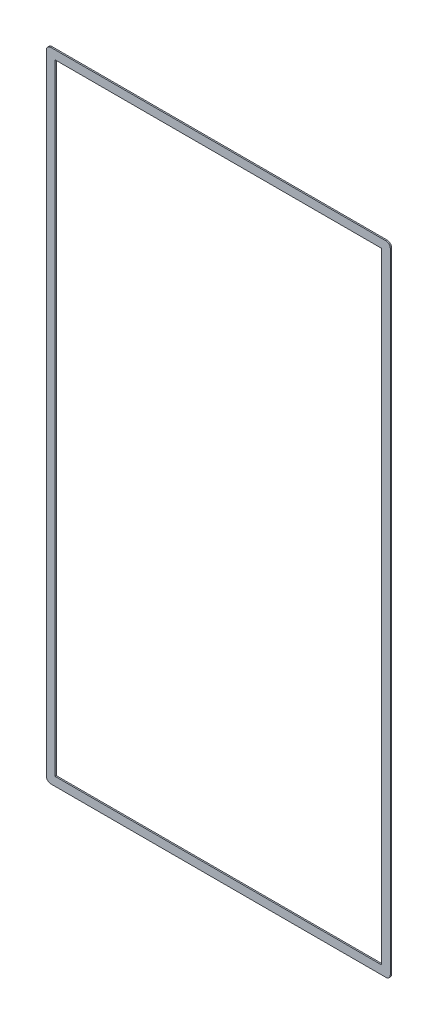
ISO-10303-21;
HEADER;
FILE_DESCRIPTION(('STEP AP214'),'2;1');
FILE_NAME('part.step','',(''),(''),'','','');
FILE_SCHEMA(('AUTOMOTIVE_DESIGN { 1 0 10303 214 1 1 1 1 }'));
ENDSEC;
DATA;
#1=APPLICATION_CONTEXT('core data for automotive mechanical design processes');
#2=APPLICATION_PROTOCOL_DEFINITION('international standard','automotive_design',2000,#1);
#3=PRODUCT_CONTEXT('',#1,'mechanical');
#4=PRODUCT('Part','Part','',(#3));
#5=PRODUCT_RELATED_PRODUCT_CATEGORY('part','',(#4));
#6=PRODUCT_DEFINITION_FORMATION('','',#4);
#7=PRODUCT_DEFINITION_CONTEXT('part definition',#1,'design');
#8=PRODUCT_DEFINITION('design','',#6,#7);
#9=PRODUCT_DEFINITION_SHAPE('','',#8);
#10=(LENGTH_UNIT() NAMED_UNIT(*) SI_UNIT(.MILLI.,.METRE.));
#11=(NAMED_UNIT(*) PLANE_ANGLE_UNIT() SI_UNIT($,.RADIAN.));
#12=(NAMED_UNIT(*) SI_UNIT($,.STERADIAN.) SOLID_ANGLE_UNIT());
#13=UNCERTAINTY_MEASURE_WITH_UNIT(LENGTH_MEASURE(1.E-05),#10,'distance_accuracy_value','');
#14=(GEOMETRIC_REPRESENTATION_CONTEXT(3) GLOBAL_UNCERTAINTY_ASSIGNED_CONTEXT((#13)) GLOBAL_UNIT_ASSIGNED_CONTEXT((#10,
#11,#12)) REPRESENTATION_CONTEXT('',''));
#15=CARTESIAN_POINT('',(0.,0.,0.));
#16=DIRECTION('',(0.,0.,1.));
#17=DIRECTION('',(1.,0.,0.));
#18=AXIS2_PLACEMENT_3D('',#15,#16,#17);
#19=CARTESIAN_POINT('',(-245.618,461.137,1.905));
#20=DIRECTION('',(0.,0.,-1.));
#21=DIRECTION('',(-1.,0.,0.));
#22=AXIS2_PLACEMENT_3D('',#19,#20,#21);
#23=CYLINDRICAL_SURFACE('',#22,6.35000000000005);
#24=CARTESIAN_POINT('',(-245.618,461.137,0.));
#25=DIRECTION('',(0.,0.,1.));
#26=DIRECTION('',(1.,0.,0.));
#27=AXIS2_PLACEMENT_3D('',#24,#25,#26);
#28=CIRCLE('',#27,6.35000000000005);
#29=CARTESIAN_POINT('',(-245.618,467.487,0.));
#30=VERTEX_POINT('',#29);
#31=CARTESIAN_POINT('',(-251.968,461.137,0.));
#32=VERTEX_POINT('',#31);
#33=EDGE_CURVE('E128',#30,#32,#28,.T.);
#34=ORIENTED_EDGE('',*,*,#33,.T.);
#35=DIRECTION('',(0.,0.,-1.));
#36=VECTOR('',#35,1.);
#37=CARTESIAN_POINT('',(-251.968,461.137,1.905));
#38=LINE('',#37,#36);
#39=CARTESIAN_POINT('',(-251.968,461.137,1.905));
#40=VERTEX_POINT('',#39);
#41=EDGE_CURVE('E11',#40,#32,#38,.T.);
#42=ORIENTED_EDGE('',*,*,#41,.F.);
#43=CARTESIAN_POINT('',(-245.618,461.137,1.905));
#44=DIRECTION('',(0.,0.,1.));
#45=DIRECTION('',(1.,0.,0.));
#46=AXIS2_PLACEMENT_3D('',#43,#44,#45);
#47=CIRCLE('',#46,6.35000000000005);
#48=CARTESIAN_POINT('',(-245.618,467.487,1.905));
#49=VERTEX_POINT('',#48);
#50=EDGE_CURVE('E157',#49,#40,#47,.T.);
#51=ORIENTED_EDGE('',*,*,#50,.F.);
#52=DIRECTION('',(0.,0.,-1.));
#53=VECTOR('',#52,1.);
#54=CARTESIAN_POINT('',(-245.618,467.487,1.905));
#55=LINE('',#54,#53);
#56=EDGE_CURVE('E175',#49,#30,#55,.T.);
#57=ORIENTED_EDGE('',*,*,#56,.T.);
#58=EDGE_LOOP('',(#34,#42,#51,#57));
#59=FACE_BOUND('',#58,.T.);
#60=ADVANCED_FACE('F33',(#59),#23,.T.);
#61=CARTESIAN_POINT('',(-251.968,461.137,1.905));
#62=DIRECTION('',(1.,0.,0.));
#63=DIRECTION('',(0.,0.,-1.));
#64=AXIS2_PLACEMENT_3D('',#61,#62,#63);
#65=PLANE('',#64);
#66=DIRECTION('',(0.,-1.,0.));
#67=VECTOR('',#66,1.);
#68=CARTESIAN_POINT('',(-251.968,461.137,0.));
#69=LINE('',#68,#67);
#70=CARTESIAN_POINT('',(-251.968,-461.137,0.));
#71=VERTEX_POINT('',#70);
#72=EDGE_CURVE('E178',#32,#71,#69,.T.);
#73=ORIENTED_EDGE('',*,*,#72,.T.);
#74=DIRECTION('',(0.,0.,-1.));
#75=VECTOR('',#74,1.);
#76=CARTESIAN_POINT('',(-251.968,-461.137,1.905));
#77=LINE('',#76,#75);
#78=CARTESIAN_POINT('',(-251.968,-461.137,1.905));
#79=VERTEX_POINT('',#78);
#80=EDGE_CURVE('E40',#79,#71,#77,.T.);
#81=ORIENTED_EDGE('',*,*,#80,.F.);
#82=DIRECTION('',(0.,-1.,0.));
#83=VECTOR('',#82,1.);
#84=CARTESIAN_POINT('',(-251.968,461.137,1.905));
#85=LINE('',#84,#83);
#86=EDGE_CURVE('E160',#40,#79,#85,.T.);
#87=ORIENTED_EDGE('',*,*,#86,.F.);
#88=ORIENTED_EDGE('',*,*,#41,.T.);
#89=EDGE_LOOP('',(#73,#81,#87,#88));
#90=FACE_BOUND('',#89,.T.);
#91=ADVANCED_FACE('F233',(#90),#65,.F.);
#92=CARTESIAN_POINT('',(-245.618,-461.137,1.905));
#93=DIRECTION('',(0.,0.,-1.));
#94=DIRECTION('',(-1.,0.,0.));
#95=AXIS2_PLACEMENT_3D('',#92,#93,#94);
#96=CYLINDRICAL_SURFACE('',#95,6.35000000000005);
#97=CARTESIAN_POINT('',(-245.618,-461.137,0.));
#98=DIRECTION('',(0.,0.,1.));
#99=DIRECTION('',(1.,0.,0.));
#100=AXIS2_PLACEMENT_3D('',#97,#98,#99);
#101=CIRCLE('',#100,6.35000000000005);
#102=CARTESIAN_POINT('',(-245.618,-467.487,0.));
#103=VERTEX_POINT('',#102);
#104=EDGE_CURVE('E180',#71,#103,#101,.T.);
#105=ORIENTED_EDGE('',*,*,#104,.T.);
#106=DIRECTION('',(0.,0.,-1.));
#107=VECTOR('',#106,1.);
#108=CARTESIAN_POINT('',(-245.618,-467.487,1.905));
#109=LINE('',#108,#107);
#110=CARTESIAN_POINT('',(-245.618,-467.487,1.905));
#111=VERTEX_POINT('',#110);
#112=EDGE_CURVE('E205',#111,#103,#109,.T.);
#113=ORIENTED_EDGE('',*,*,#112,.F.);
#114=CARTESIAN_POINT('',(-245.618,-461.137,1.905));
#115=DIRECTION('',(0.,0.,1.));
#116=DIRECTION('',(1.,0.,0.));
#117=AXIS2_PLACEMENT_3D('',#114,#115,#116);
#118=CIRCLE('',#117,6.35000000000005);
#119=EDGE_CURVE('E163',#79,#111,#118,.T.);
#120=ORIENTED_EDGE('',*,*,#119,.F.);
#121=ORIENTED_EDGE('',*,*,#80,.T.);
#122=EDGE_LOOP('',(#105,#113,#120,#121));
#123=FACE_BOUND('',#122,.T.);
#124=ADVANCED_FACE('F212',(#123),#96,.T.);
#125=CARTESIAN_POINT('',(-245.618,-467.487,1.905));
#126=DIRECTION('',(0.,1.,0.));
#127=DIRECTION('',(0.,0.,1.));
#128=AXIS2_PLACEMENT_3D('',#125,#126,#127);
#129=PLANE('',#128);
#130=DIRECTION('',(1.,0.,0.));
#131=VECTOR('',#130,1.);
#132=CARTESIAN_POINT('',(-245.618,-467.487,0.));
#133=LINE('',#132,#131);
#134=CARTESIAN_POINT('',(245.618,-467.487,0.));
#135=VERTEX_POINT('',#134);
#136=EDGE_CURVE('E182',#103,#135,#133,.T.);
#137=ORIENTED_EDGE('',*,*,#136,.T.);
#138=DIRECTION('',(0.,0.,-1.));
#139=VECTOR('',#138,1.);
#140=CARTESIAN_POINT('',(245.618,-467.487,1.905));
#141=LINE('',#140,#139);
#142=CARTESIAN_POINT('',(245.618,-467.487,1.905));
#143=VERTEX_POINT('',#142);
#144=EDGE_CURVE('E202',#143,#135,#141,.T.);
#145=ORIENTED_EDGE('',*,*,#144,.F.);
#146=DIRECTION('',(1.,0.,0.));
#147=VECTOR('',#146,1.);
#148=CARTESIAN_POINT('',(-245.618,-467.487,1.905));
#149=LINE('',#148,#147);
#150=EDGE_CURVE('E165',#111,#143,#149,.T.);
#151=ORIENTED_EDGE('',*,*,#150,.F.);
#152=ORIENTED_EDGE('',*,*,#112,.T.);
#153=EDGE_LOOP('',(#137,#145,#151,#152));
#154=FACE_BOUND('',#153,.T.);
#155=ADVANCED_FACE('F221',(#154),#129,.F.);
#156=CARTESIAN_POINT('',(245.618,-461.137,1.905));
#157=DIRECTION('',(0.,0.,-1.));
#158=DIRECTION('',(-1.,0.,0.));
#159=AXIS2_PLACEMENT_3D('',#156,#157,#158);
#160=CYLINDRICAL_SURFACE('',#159,6.35000000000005);
#161=CARTESIAN_POINT('',(245.618,-461.137,0.));
#162=DIRECTION('',(0.,0.,1.));
#163=DIRECTION('',(1.,0.,0.));
#164=AXIS2_PLACEMENT_3D('',#161,#162,#163);
#165=CIRCLE('',#164,6.35000000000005);
#166=CARTESIAN_POINT('',(251.968,-461.137,0.));
#167=VERTEX_POINT('',#166);
#168=EDGE_CURVE('E184',#135,#167,#165,.T.);
#169=ORIENTED_EDGE('',*,*,#168,.T.);
#170=DIRECTION('',(0.,0.,-1.));
#171=VECTOR('',#170,1.);
#172=CARTESIAN_POINT('',(251.968,-461.137,1.905));
#173=LINE('',#172,#171);
#174=CARTESIAN_POINT('',(251.968,-461.137,1.905));
#175=VERTEX_POINT('',#174);
#176=EDGE_CURVE('E199',#175,#167,#173,.T.);
#177=ORIENTED_EDGE('',*,*,#176,.F.);
#178=CARTESIAN_POINT('',(245.618,-461.137,1.905));
#179=DIRECTION('',(0.,0.,1.));
#180=DIRECTION('',(1.,0.,0.));
#181=AXIS2_PLACEMENT_3D('',#178,#179,#180);
#182=CIRCLE('',#181,6.35000000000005);
#183=EDGE_CURVE('E167',#143,#175,#182,.T.);
#184=ORIENTED_EDGE('',*,*,#183,.F.);
#185=ORIENTED_EDGE('',*,*,#144,.T.);
#186=EDGE_LOOP('',(#169,#177,#184,#185));
#187=FACE_BOUND('',#186,.T.);
#188=ADVANCED_FACE('F225',(#187),#160,.T.);
#189=CARTESIAN_POINT('',(251.968,-461.137,1.905));
#190=DIRECTION('',(-1.,0.,0.));
#191=DIRECTION('',(0.,0.,1.));
#192=AXIS2_PLACEMENT_3D('',#189,#190,#191);
#193=PLANE('',#192);
#194=DIRECTION('',(0.,1.,0.));
#195=VECTOR('',#194,1.);
#196=CARTESIAN_POINT('',(251.968,-461.137,0.));
#197=LINE('',#196,#195);
#198=CARTESIAN_POINT('',(251.968,461.137,0.));
#199=VERTEX_POINT('',#198);
#200=EDGE_CURVE('E186',#167,#199,#197,.T.);
#201=ORIENTED_EDGE('',*,*,#200,.T.);
#202=DIRECTION('',(0.,0.,-1.));
#203=VECTOR('',#202,1.);
#204=CARTESIAN_POINT('',(251.968,461.137,1.905));
#205=LINE('',#204,#203);
#206=CARTESIAN_POINT('',(251.968,461.137,1.905));
#207=VERTEX_POINT('',#206);
#208=EDGE_CURVE('E196',#207,#199,#205,.T.);
#209=ORIENTED_EDGE('',*,*,#208,.F.);
#210=DIRECTION('',(0.,1.,0.));
#211=VECTOR('',#210,1.);
#212=CARTESIAN_POINT('',(251.968,-461.137,1.905));
#213=LINE('',#212,#211);
#214=EDGE_CURVE('E169',#175,#207,#213,.T.);
#215=ORIENTED_EDGE('',*,*,#214,.F.);
#216=ORIENTED_EDGE('',*,*,#176,.T.);
#217=EDGE_LOOP('',(#201,#209,#215,#216));
#218=FACE_BOUND('',#217,.T.);
#219=ADVANCED_FACE('F246',(#218),#193,.F.);
#220=CARTESIAN_POINT('',(245.618,461.137,1.905));
#221=DIRECTION('',(0.,0.,-1.));
#222=DIRECTION('',(-1.,0.,0.));
#223=AXIS2_PLACEMENT_3D('',#220,#221,#222);
#224=CYLINDRICAL_SURFACE('',#223,6.35000000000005);
#225=CARTESIAN_POINT('',(245.618,461.137,0.));
#226=DIRECTION('',(0.,0.,1.));
#227=DIRECTION('',(1.,0.,0.));
#228=AXIS2_PLACEMENT_3D('',#225,#226,#227);
#229=CIRCLE('',#228,6.35000000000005);
#230=CARTESIAN_POINT('',(245.618,467.487,0.));
#231=VERTEX_POINT('',#230);
#232=EDGE_CURVE('E188',#199,#231,#229,.T.);
#233=ORIENTED_EDGE('',*,*,#232,.T.);
#234=DIRECTION('',(0.,0.,-1.));
#235=VECTOR('',#234,1.);
#236=CARTESIAN_POINT('',(245.618,467.487,1.905));
#237=LINE('',#236,#235);
#238=CARTESIAN_POINT('',(245.618,467.487,1.905));
#239=VERTEX_POINT('',#238);
#240=EDGE_CURVE('E193',#239,#231,#237,.T.);
#241=ORIENTED_EDGE('',*,*,#240,.F.);
#242=CARTESIAN_POINT('',(245.618,461.137,1.905));
#243=DIRECTION('',(0.,0.,1.));
#244=DIRECTION('',(1.,0.,0.));
#245=AXIS2_PLACEMENT_3D('',#242,#243,#244);
#246=CIRCLE('',#245,6.35000000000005);
#247=EDGE_CURVE('E171',#207,#239,#246,.T.);
#248=ORIENTED_EDGE('',*,*,#247,.F.);
#249=ORIENTED_EDGE('',*,*,#208,.T.);
#250=EDGE_LOOP('',(#233,#241,#248,#249));
#251=FACE_BOUND('',#250,.T.);
#252=ADVANCED_FACE('F244',(#251),#224,.T.);
#253=CARTESIAN_POINT('',(245.618,467.487,1.905));
#254=DIRECTION('',(0.,-1.,0.));
#255=DIRECTION('',(0.,0.,-1.));
#256=AXIS2_PLACEMENT_3D('',#253,#254,#255);
#257=PLANE('',#256);
#258=DIRECTION('',(-1.,0.,0.));
#259=VECTOR('',#258,1.);
#260=CARTESIAN_POINT('',(245.618,467.487,0.));
#261=LINE('',#260,#259);
#262=EDGE_CURVE('E161',#231,#30,#261,.T.);
#263=ORIENTED_EDGE('',*,*,#262,.T.);
#264=ORIENTED_EDGE('',*,*,#56,.F.);
#265=DIRECTION('',(-1.,0.,0.));
#266=VECTOR('',#265,1.);
#267=CARTESIAN_POINT('',(245.618,467.487,1.905));
#268=LINE('',#267,#266);
#269=EDGE_CURVE('E173',#239,#49,#268,.T.);
#270=ORIENTED_EDGE('',*,*,#269,.F.);
#271=ORIENTED_EDGE('',*,*,#240,.T.);
#272=EDGE_LOOP('',(#263,#264,#270,#271));
#273=FACE_BOUND('',#272,.T.);
#274=ADVANCED_FACE('F239',(#273),#257,.F.);
#275=CARTESIAN_POINT('',(-245.618,461.137,1.905));
#276=DIRECTION('',(0.,0.,1.));
#277=DIRECTION('',(1.,0.,0.));
#278=AXIS2_PLACEMENT_3D('',#275,#276,#277);
#279=PLANE('',#278);
#280=DIRECTION('',(-1.,0.,0.));
#281=VECTOR('',#280,1.);
#282=CARTESIAN_POINT('',(245.618,454.787,1.905));
#283=LINE('',#282,#281);
#284=CARTESIAN_POINT('',(239.268,454.787,1.905));
#285=VERTEX_POINT('',#284);
#286=CARTESIAN_POINT('',(-239.268,454.787,1.905));
#287=VERTEX_POINT('',#286);
#288=EDGE_CURVE('E125',#285,#287,#283,.T.);
#289=ORIENTED_EDGE('',*,*,#288,.F.);
#290=DIRECTION('',(0.,1.,0.));
#291=VECTOR('',#290,1.);
#292=CARTESIAN_POINT('',(239.268,-461.137,1.905));
#293=LINE('',#292,#291);
#294=CARTESIAN_POINT('',(239.268,-454.787,1.905));
#295=VERTEX_POINT('',#294);
#296=EDGE_CURVE('E153',#295,#285,#293,.T.);
#297=ORIENTED_EDGE('',*,*,#296,.F.);
#298=DIRECTION('',(1.,0.,0.));
#299=VECTOR('',#298,1.);
#300=CARTESIAN_POINT('',(-245.618,-454.787,1.905));
#301=LINE('',#300,#299);
#302=CARTESIAN_POINT('',(-239.268,-454.787,1.905));
#303=VERTEX_POINT('',#302);
#304=EDGE_CURVE('E146',#303,#295,#301,.T.);
#305=ORIENTED_EDGE('',*,*,#304,.F.);
#306=DIRECTION('',(0.,-1.,0.));
#307=VECTOR('',#306,1.);
#308=CARTESIAN_POINT('',(-239.268,461.137,1.905));
#309=LINE('',#308,#307);
#310=EDGE_CURVE('E144',#287,#303,#309,.T.);
#311=ORIENTED_EDGE('',*,*,#310,.F.);
#312=EDGE_LOOP('',(#289,#297,#305,#311));
#313=FACE_BOUND('',#312,.T.);
#314=ORIENTED_EDGE('',*,*,#50,.T.);
#315=ORIENTED_EDGE('',*,*,#86,.T.);
#316=ORIENTED_EDGE('',*,*,#119,.T.);
#317=ORIENTED_EDGE('',*,*,#150,.T.);
#318=ORIENTED_EDGE('',*,*,#183,.T.);
#319=ORIENTED_EDGE('',*,*,#214,.T.);
#320=ORIENTED_EDGE('',*,*,#247,.T.);
#321=ORIENTED_EDGE('',*,*,#269,.T.);
#322=EDGE_LOOP('',(#314,#315,#316,#317,#318,#319,#320,#321));
#323=FACE_BOUND('',#322,.T.);
#324=ADVANCED_FACE('F229',(#313,#323),#279,.T.);
#325=CARTESIAN_POINT('',(-245.618,461.137,0.));
#326=DIRECTION('',(0.,0.,1.));
#327=DIRECTION('',(1.,0.,0.));
#328=AXIS2_PLACEMENT_3D('',#325,#326,#327);
#329=PLANE('',#328);
#330=DIRECTION('',(-1.,0.,0.));
#331=VECTOR('',#330,1.);
#332=CARTESIAN_POINT('',(245.618,454.787,0.));
#333=LINE('',#332,#331);
#334=CARTESIAN_POINT('',(239.268,454.787,0.));
#335=VERTEX_POINT('',#334);
#336=CARTESIAN_POINT('',(-239.268,454.787,0.));
#337=VERTEX_POINT('',#336);
#338=EDGE_CURVE('E122',#335,#337,#333,.T.);
#339=ORIENTED_EDGE('',*,*,#338,.T.);
#340=DIRECTION('',(0.,-1.,0.));
#341=VECTOR('',#340,1.);
#342=CARTESIAN_POINT('',(-239.268,461.137,0.));
#343=LINE('',#342,#341);
#344=CARTESIAN_POINT('',(-239.268,-454.787,0.));
#345=VERTEX_POINT('',#344);
#346=EDGE_CURVE('E133',#337,#345,#343,.T.);
#347=ORIENTED_EDGE('',*,*,#346,.T.);
#348=DIRECTION('',(1.,0.,0.));
#349=VECTOR('',#348,1.);
#350=CARTESIAN_POINT('',(-245.618,-454.787,0.));
#351=LINE('',#350,#349);
#352=CARTESIAN_POINT('',(239.268,-454.787,0.));
#353=VERTEX_POINT('',#352);
#354=EDGE_CURVE('E138',#345,#353,#351,.T.);
#355=ORIENTED_EDGE('',*,*,#354,.T.);
#356=DIRECTION('',(0.,1.,0.));
#357=VECTOR('',#356,1.);
#358=CARTESIAN_POINT('',(239.268,-461.137,0.));
#359=LINE('',#358,#357);
#360=EDGE_CURVE('E143',#353,#335,#359,.T.);
#361=ORIENTED_EDGE('',*,*,#360,.T.);
#362=EDGE_LOOP('',(#339,#347,#355,#361));
#363=FACE_BOUND('',#362,.T.);
#364=ORIENTED_EDGE('',*,*,#33,.F.);
#365=ORIENTED_EDGE('',*,*,#262,.F.);
#366=ORIENTED_EDGE('',*,*,#232,.F.);
#367=ORIENTED_EDGE('',*,*,#200,.F.);
#368=ORIENTED_EDGE('',*,*,#168,.F.);
#369=ORIENTED_EDGE('',*,*,#136,.F.);
#370=ORIENTED_EDGE('',*,*,#104,.F.);
#371=ORIENTED_EDGE('',*,*,#72,.F.);
#372=EDGE_LOOP('',(#364,#365,#366,#367,#368,#369,#370,#371));
#373=FACE_BOUND('',#372,.T.);
#374=ADVANCED_FACE('F141',(#363,#373),#329,.F.);
#375=CARTESIAN_POINT('',(-239.268,461.137,1.905));
#376=DIRECTION('',(1.,0.,0.));
#377=DIRECTION('',(0.,0.,-1.));
#378=AXIS2_PLACEMENT_3D('',#375,#376,#377);
#379=PLANE('',#378);
#380=ORIENTED_EDGE('',*,*,#346,.F.);
#381=DIRECTION('',(0.,0.,-1.));
#382=VECTOR('',#381,1.);
#383=CARTESIAN_POINT('',(-239.268,454.787,1.905));
#384=LINE('',#383,#382);
#385=EDGE_CURVE('E117',#287,#337,#384,.T.);
#386=ORIENTED_EDGE('',*,*,#385,.F.);
#387=ORIENTED_EDGE('',*,*,#310,.T.);
#388=DIRECTION('',(0.,0.,-1.));
#389=VECTOR('',#388,1.);
#390=CARTESIAN_POINT('',(-239.268,-454.787,1.905));
#391=LINE('',#390,#389);
#392=EDGE_CURVE('E129',#303,#345,#391,.T.);
#393=ORIENTED_EDGE('',*,*,#392,.T.);
#394=EDGE_LOOP('',(#380,#386,#387,#393));
#395=FACE_BOUND('',#394,.T.);
#396=ADVANCED_FACE('F134',(#395),#379,.T.);
#397=CARTESIAN_POINT('',(-245.618,-454.787,1.905));
#398=DIRECTION('',(0.,1.,0.));
#399=DIRECTION('',(0.,0.,1.));
#400=AXIS2_PLACEMENT_3D('',#397,#398,#399);
#401=PLANE('',#400);
#402=ORIENTED_EDGE('',*,*,#354,.F.);
#403=ORIENTED_EDGE('',*,*,#392,.F.);
#404=ORIENTED_EDGE('',*,*,#304,.T.);
#405=DIRECTION('',(0.,0.,-1.));
#406=VECTOR('',#405,1.);
#407=CARTESIAN_POINT('',(239.268,-454.787,1.905));
#408=LINE('',#407,#406);
#409=EDGE_CURVE('E47',#295,#353,#408,.T.);
#410=ORIENTED_EDGE('',*,*,#409,.T.);
#411=EDGE_LOOP('',(#402,#403,#404,#410));
#412=FACE_BOUND('',#411,.T.);
#413=ADVANCED_FACE('F317',(#412),#401,.T.);
#414=CARTESIAN_POINT('',(239.268,-461.137,1.905));
#415=DIRECTION('',(-1.,0.,0.));
#416=DIRECTION('',(0.,0.,1.));
#417=AXIS2_PLACEMENT_3D('',#414,#415,#416);
#418=PLANE('',#417);
#419=ORIENTED_EDGE('',*,*,#360,.F.);
#420=ORIENTED_EDGE('',*,*,#409,.F.);
#421=ORIENTED_EDGE('',*,*,#296,.T.);
#422=DIRECTION('',(0.,0.,-1.));
#423=VECTOR('',#422,1.);
#424=CARTESIAN_POINT('',(239.268,454.787,1.905));
#425=LINE('',#424,#423);
#426=EDGE_CURVE('E156',#285,#335,#425,.T.);
#427=ORIENTED_EDGE('',*,*,#426,.T.);
#428=EDGE_LOOP('',(#419,#420,#421,#427));
#429=FACE_BOUND('',#428,.T.);
#430=ADVANCED_FACE('F326',(#429),#418,.T.);
#431=CARTESIAN_POINT('',(245.618,454.787,1.905));
#432=DIRECTION('',(0.,-1.,0.));
#433=DIRECTION('',(0.,0.,-1.));
#434=AXIS2_PLACEMENT_3D('',#431,#432,#433);
#435=PLANE('',#434);
#436=ORIENTED_EDGE('',*,*,#338,.F.);
#437=ORIENTED_EDGE('',*,*,#426,.F.);
#438=ORIENTED_EDGE('',*,*,#288,.T.);
#439=ORIENTED_EDGE('',*,*,#385,.T.);
#440=EDGE_LOOP('',(#436,#437,#438,#439));
#441=FACE_BOUND('',#440,.T.);
#442=ADVANCED_FACE('F119',(#441),#435,.T.);
#443=CLOSED_SHELL('',(#60,#91,#124,#155,#188,#219,#252,#274,#324,#374,#396,#413,#430,#442));
#444=MANIFOLD_SOLID_BREP('B2',#443);
#445=ADVANCED_BREP_SHAPE_REPRESENTATION('',(#18,#444),#14);
#446=SHAPE_DEFINITION_REPRESENTATION(#9,#445);
ENDSEC;
END-ISO-10303-21;
